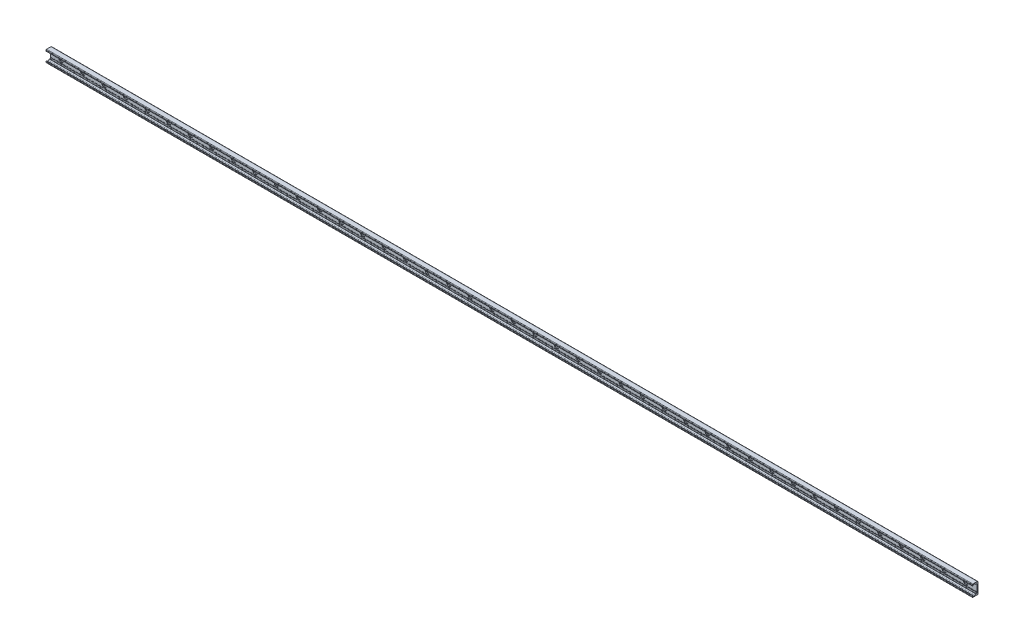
from build123d import *

# Parameters (mm, degrees)
BOSS_EXTRUDE1_DEPTH = 1720
SKETCH2_R           = 9
SKETCH2_R_2         = 4.5
CUT_EXTRUDE1_DEPTH  = 3.1
SKETCH2_2_R         = 4.5
CUT_EXTRUDE2_DEPTH  = 1721.213504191
LPATTERN1_COUNT     = 43
LPATTERN1_PITCH     = 80


with BuildPart() as part:
    # Sketch1 → Boss-Extrude1 (new, symmetric)
    with BuildSketch(Plane(origin=(0, 0, 0), x_dir=(0, 0, -1), z_dir=(1, 0, 0))):
        with BuildLine():
            Line((0, 0), (0, 19))
            ThreePointArc((0, 19), (-0.732233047, 20.767766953), (-2.5, 21.5))
            Line((-2.5, 21.5), (-19, 21.5))
            ThreePointArc((-19, 21.5), (-20.414213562, 20.914213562), (-21, 19.5))
            Line((-21, 19.5), (-21, 16.625057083))
            ThreePointArc((-21, 16.625057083), (-20.553251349, 15.888838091), (-19.693931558, 15.945160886))
            Line((-19.693931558, 15.945160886), (-16.794305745, 17.975500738))
            ThreePointArc((-16.794305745, 17.975500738), (-14.5, 18.69889256), (-12.205694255, 17.975500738))
            Line((-12.205694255, 17.975500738), (-8.829831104, 15.611695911))
            ThreePointArc((-8.829831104, 15.611695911), (-8.28408983, 15.342566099), (-7.682678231, 15.25))
            Line((-7.682678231, 15.25), (-6.5, 15.25))
            ThreePointArc((-6.5, 15.25), (-5.085786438, 14.664213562), (-4.5, 13.25))
            Line((-4.5, 13.25), (-4.5, -10.75))
            ThreePointArc((-4.5, -10.75), (-4.25, -11), (-4.5, -11.25))
            Line((-4.5, -11.25), (-4.5, -12.25))
            ThreePointArc((-4.5, -12.25), (-4.25, -12.5), (-4.5, -12.75))
            Line((-4.5, -12.75), (-4.5, -13.25))
            ThreePointArc((-4.5, -13.25), (-5.085786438, -14.664213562), (-6.5, -15.25))
            Line((-6.5, -15.25), (-7.682678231, -15.25))
            ThreePointArc((-7.682678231, -15.25), (-8.28408983, -15.342566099), (-8.829831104, -15.611695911))
            Line((-8.829831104, -15.611695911), (-12.205694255, -17.975500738))
            ThreePointArc((-12.205694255, -17.975500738), (-14.5, -18.69889256), (-16.794305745, -17.975500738))
            Line((-16.794305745, -17.975500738), (-19.693931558, -15.945160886))
            ThreePointArc((-19.693931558, -15.945160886), (-20.553251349, -15.888838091), (-21, -16.625057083))
            Line((-21, -16.625057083), (-21, -19.5))
            ThreePointArc((-21, -19.5), (-20.414213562, -20.914213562), (-19, -21.5))
            Line((-19, -21.5), (-2.5, -21.5))
            ThreePointArc((-2.5, -21.5), (-0.732233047, -20.767766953), (0, -19))
            Line((0, -19), (0, 0))
        make_face()
    extrude(amount=BOSS_EXTRUDE1_DEPTH, both=True)

    # Sketch2 → Cut-Extrude1 (cut)
    with BuildSketch(Plane.XY.offset(4.5)):
        with Locations((1680, 0)):
            Circle(SKETCH2_R)
        with Locations((1680, 0)):
            Circle(SKETCH2_R_2, mode=Mode.SUBTRACT)
    cut_extrude1 = extrude(amount=-CUT_EXTRUDE1_DEPTH, mode=Mode.SUBTRACT)

    # Sketch2_2 → Cut-Extrude2 (cut, through all)
    with BuildSketch(Plane.XY.offset(4.5)):
        with Locations((1680, 0)):
            Circle(SKETCH2_2_R)
    cut_extrude2 = extrude(amount=-CUT_EXTRUDE2_DEPTH, mode=Mode.SUBTRACT)

    # LPattern1: Cut-Extrude1, Cut-Extrude2 ×43
    with Locations(*[(-i * LPATTERN1_PITCH, 0, 0) for i in range(1, LPATTERN1_COUNT)]):
        add(cut_extrude1, mode=Mode.SUBTRACT)
        add(cut_extrude2, mode=Mode.SUBTRACT)


solid = part.part
